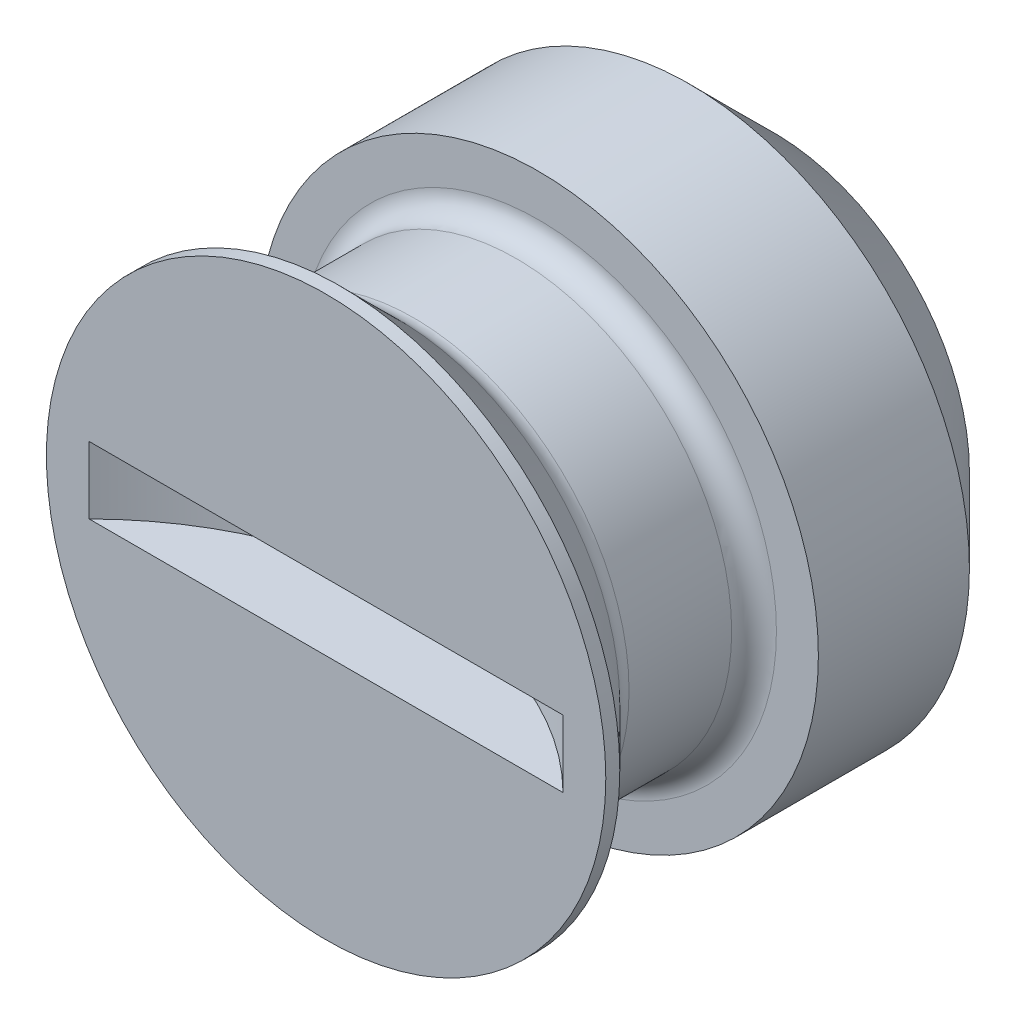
ISO-10303-21;
HEADER;
FILE_DESCRIPTION(('STEP AP214'),'2;1');
FILE_NAME('part.step','',(''),(''),'','','');
FILE_SCHEMA(('AUTOMOTIVE_DESIGN { 1 0 10303 214 1 1 1 1 }'));
ENDSEC;
DATA;
#1=APPLICATION_CONTEXT('core data for automotive mechanical design processes');
#2=APPLICATION_PROTOCOL_DEFINITION('international standard','automotive_design',2000,#1);
#3=PRODUCT_CONTEXT('',#1,'mechanical');
#4=PRODUCT('Part','Part','',(#3));
#5=PRODUCT_RELATED_PRODUCT_CATEGORY('part','',(#4));
#6=PRODUCT_DEFINITION_FORMATION('','',#4);
#7=PRODUCT_DEFINITION_CONTEXT('part definition',#1,'design');
#8=PRODUCT_DEFINITION('design','',#6,#7);
#9=PRODUCT_DEFINITION_SHAPE('','',#8);
#10=(LENGTH_UNIT() NAMED_UNIT(*) SI_UNIT(.MILLI.,.METRE.));
#11=(NAMED_UNIT(*) PLANE_ANGLE_UNIT() SI_UNIT($,.RADIAN.));
#12=(NAMED_UNIT(*) SI_UNIT($,.STERADIAN.) SOLID_ANGLE_UNIT());
#13=UNCERTAINTY_MEASURE_WITH_UNIT(LENGTH_MEASURE(1.E-05),#10,'distance_accuracy_value','');
#14=(GEOMETRIC_REPRESENTATION_CONTEXT(3) GLOBAL_UNCERTAINTY_ASSIGNED_CONTEXT((#13)) GLOBAL_UNIT_ASSIGNED_CONTEXT((#10,
#11,#12)) REPRESENTATION_CONTEXT('',''));
#15=CARTESIAN_POINT('',(0.,0.,0.));
#16=DIRECTION('',(0.,0.,1.));
#17=DIRECTION('',(1.,0.,0.));
#18=AXIS2_PLACEMENT_3D('',#15,#16,#17);
#19=CARTESIAN_POINT('',(0.,5.,0.));
#20=DIRECTION('',(0.,0.,-1.));
#21=DIRECTION('',(-1.,0.,0.));
#22=AXIS2_PLACEMENT_3D('',#19,#20,#21);
#23=PLANE('',#22);
#24=CARTESIAN_POINT('',(0.,0.,0.));
#25=DIRECTION('',(0.,0.,1.));
#26=DIRECTION('',(1.,0.,0.));
#27=AXIS2_PLACEMENT_3D('',#24,#25,#26);
#28=CIRCLE('',#27,5.);
#29=CARTESIAN_POINT('',(5.,0.,0.));
#30=VERTEX_POINT('',#29);
#31=EDGE_CURVE('E76',#30,#30,#28,.T.);
#32=ORIENTED_EDGE('',*,*,#31,.T.);
#33=EDGE_LOOP('',(#32));
#34=FACE_BOUND('',#33,.T.);
#35=DIRECTION('',(1.,0.,0.));
#36=VECTOR('',#35,1.);
#37=CARTESIAN_POINT('',(0.,-0.6,0.));
#38=LINE('',#37,#36);
#39=CARTESIAN_POINT('',(-4.23526858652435,-0.6,0.));
#40=VERTEX_POINT('',#39);
#41=CARTESIAN_POINT('',(4.23526858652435,-0.6,0.));
#42=VERTEX_POINT('',#41);
#43=EDGE_CURVE('E9',#40,#42,#38,.T.);
#44=ORIENTED_EDGE('',*,*,#43,.F.);
#45=DIRECTION('',(0.,1.,0.));
#46=VECTOR('',#45,1.);
#47=CARTESIAN_POINT('',(-4.23526858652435,-0.6,0.));
#48=LINE('',#47,#46);
#49=CARTESIAN_POINT('',(-4.23526858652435,0.6,0.));
#50=VERTEX_POINT('',#49);
#51=EDGE_CURVE('E22',#40,#50,#48,.T.);
#52=ORIENTED_EDGE('',*,*,#51,.T.);
#53=DIRECTION('',(1.,0.,0.));
#54=VECTOR('',#53,1.);
#55=CARTESIAN_POINT('',(0.,0.6,0.));
#56=LINE('',#55,#54);
#57=CARTESIAN_POINT('',(4.23526858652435,0.6,0.));
#58=VERTEX_POINT('',#57);
#59=EDGE_CURVE('E40',#50,#58,#56,.T.);
#60=ORIENTED_EDGE('',*,*,#59,.T.);
#61=DIRECTION('',(0.,1.,0.));
#62=VECTOR('',#61,1.);
#63=CARTESIAN_POINT('',(4.23526858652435,-0.6,0.));
#64=LINE('',#63,#62);
#65=EDGE_CURVE('E44',#58,#42,#64,.F.);
#66=ORIENTED_EDGE('',*,*,#65,.T.);
#67=EDGE_LOOP('',(#44,#52,#60,#66));
#68=FACE_BOUND('',#67,.T.);
#69=ADVANCED_FACE('F14',(#34,#68),#23,.F.);
#70=CARTESIAN_POINT('',(0.,3.49999999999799,-7.99999999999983));
#71=DIRECTION('',(0.,0.,1.));
#72=DIRECTION('',(1.,0.,0.));
#73=AXIS2_PLACEMENT_3D('',#70,#71,#72);
#74=PLANE('',#73);
#75=CARTESIAN_POINT('',(0.,0.,-7.99999999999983));
#76=DIRECTION('',(0.,0.,1.));
#77=DIRECTION('',(1.,0.,0.));
#78=AXIS2_PLACEMENT_3D('',#75,#76,#77);
#79=CIRCLE('',#78,3.49999999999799);
#80=CARTESIAN_POINT('',(3.49999999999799,0.,-7.99999999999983));
#81=VERTEX_POINT('',#80);
#82=EDGE_CURVE('E45',#81,#81,#79,.T.);
#83=ORIENTED_EDGE('',*,*,#82,.F.);
#84=EDGE_LOOP('',(#83));
#85=FACE_BOUND('',#84,.T.);
#86=ADVANCED_FACE('F16',(#85),#74,.F.);
#87=CARTESIAN_POINT('',(0.,0.,-7.99999999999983));
#88=DIRECTION('',(0.,0.,1.));
#89=DIRECTION('',(1.,0.,0.));
#90=AXIS2_PLACEMENT_3D('',#87,#88,#89);
#91=CONICAL_SURFACE('',#90,3.49999999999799,0.785398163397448);
#92=CARTESIAN_POINT('',(0.,0.,-6.49999999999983));
#93=DIRECTION('',(0.,0.,1.));
#94=DIRECTION('',(1.,0.,0.));
#95=AXIS2_PLACEMENT_3D('',#92,#93,#94);
#96=CIRCLE('',#95,4.99999999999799);
#97=CARTESIAN_POINT('',(4.99999999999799,0.,-6.49999999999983));
#98=VERTEX_POINT('',#97);
#99=EDGE_CURVE('E55',#98,#98,#96,.T.);
#100=ORIENTED_EDGE('',*,*,#99,.F.);
#101=EDGE_LOOP('',(#100));
#102=FACE_BOUND('',#101,.T.);
#103=ORIENTED_EDGE('',*,*,#82,.T.);
#104=EDGE_LOOP('',(#103));
#105=FACE_BOUND('',#104,.T.);
#106=ADVANCED_FACE('F99',(#102,#105),#91,.T.);
#107=CARTESIAN_POINT('',(0.,0.,0.));
#108=DIRECTION('',(0.,0.,1.));
#109=DIRECTION('',(1.,0.,0.));
#110=AXIS2_PLACEMENT_3D('',#107,#108,#109);
#111=CYLINDRICAL_SURFACE('',#110,4.99999999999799);
#112=CARTESIAN_POINT('',(0.,0.,-3.80000000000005));
#113=DIRECTION('',(0.,0.,1.));
#114=DIRECTION('',(1.,0.,0.));
#115=AXIS2_PLACEMENT_3D('',#112,#113,#114);
#116=CIRCLE('',#115,4.99999999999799);
#117=CARTESIAN_POINT('',(4.99999999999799,0.,-3.80000000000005));
#118=VERTEX_POINT('',#117);
#119=EDGE_CURVE('E58',#118,#118,#116,.T.);
#120=ORIENTED_EDGE('',*,*,#119,.F.);
#121=EDGE_LOOP('',(#120));
#122=FACE_BOUND('',#121,.T.);
#123=ORIENTED_EDGE('',*,*,#99,.T.);
#124=EDGE_LOOP('',(#123));
#125=FACE_BOUND('',#124,.T.);
#126=ADVANCED_FACE('F124',(#122,#125),#111,.T.);
#127=CARTESIAN_POINT('',(0.,4.99999999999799,-3.80000000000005));
#128=DIRECTION('',(0.,0.,-1.));
#129=DIRECTION('',(-1.,0.,0.));
#130=AXIS2_PLACEMENT_3D('',#127,#128,#129);
#131=PLANE('',#130);
#132=CARTESIAN_POINT('',(0.,0.,-3.80000000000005));
#133=DIRECTION('',(0.,0.,1.));
#134=DIRECTION('',(1.,0.,0.));
#135=AXIS2_PLACEMENT_3D('',#132,#133,#134);
#136=CIRCLE('',#135,4.24999999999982);
#137=CARTESIAN_POINT('',(4.24999999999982,0.,-3.80000000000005));
#138=VERTEX_POINT('',#137);
#139=EDGE_CURVE('E61',#138,#138,#136,.T.);
#140=ORIENTED_EDGE('',*,*,#139,.F.);
#141=EDGE_LOOP('',(#140));
#142=FACE_BOUND('',#141,.T.);
#143=ORIENTED_EDGE('',*,*,#119,.T.);
#144=EDGE_LOOP('',(#143));
#145=FACE_BOUND('',#144,.T.);
#146=ADVANCED_FACE('F120',(#142,#145),#131,.F.);
#147=CARTESIAN_POINT('',(0.,0.,-3.40000000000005));
#148=DIRECTION('',(0.,0.,1.));
#149=DIRECTION('',(1.,0.,0.));
#150=AXIS2_PLACEMENT_3D('',#147,#148,#149);
#151=TOROIDAL_SURFACE('',#150,4.24999999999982,0.4);
#152=CARTESIAN_POINT('',(0.,0.,-3.40000000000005));
#153=DIRECTION('',(0.,0.,1.));
#154=DIRECTION('',(1.,0.,0.));
#155=AXIS2_PLACEMENT_3D('',#152,#153,#154);
#156=CIRCLE('',#155,3.84999999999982);
#157=CARTESIAN_POINT('',(3.84999999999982,0.,-3.40000000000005));
#158=VERTEX_POINT('',#157);
#159=EDGE_CURVE('E64',#158,#158,#156,.T.);
#160=ORIENTED_EDGE('',*,*,#159,.F.);
#161=EDGE_LOOP('',(#160));
#162=FACE_BOUND('',#161,.T.);
#163=ORIENTED_EDGE('',*,*,#139,.T.);
#164=EDGE_LOOP('',(#163));
#165=FACE_BOUND('',#164,.T.);
#166=ADVANCED_FACE('F116',(#162,#165),#151,.F.);
#167=CARTESIAN_POINT('',(0.,0.,0.));
#168=DIRECTION('',(0.,0.,1.));
#169=DIRECTION('',(1.,0.,0.));
#170=AXIS2_PLACEMENT_3D('',#167,#168,#169);
#171=CYLINDRICAL_SURFACE('',#170,3.84999999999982);
#172=CARTESIAN_POINT('',(0.,0.,-1.56568542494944));
#173=DIRECTION('',(0.,0.,1.));
#174=DIRECTION('',(1.,0.,0.));
#175=AXIS2_PLACEMENT_3D('',#172,#173,#174);
#176=CIRCLE('',#175,3.84999999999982);
#177=CARTESIAN_POINT('',(3.84999999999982,0.,-1.56568542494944));
#178=VERTEX_POINT('',#177);
#179=EDGE_CURVE('E67',#178,#178,#176,.T.);
#180=ORIENTED_EDGE('',*,*,#179,.F.);
#181=EDGE_LOOP('',(#180));
#182=FACE_BOUND('',#181,.T.);
#183=ORIENTED_EDGE('',*,*,#159,.T.);
#184=EDGE_LOOP('',(#183));
#185=FACE_BOUND('',#184,.T.);
#186=ADVANCED_FACE('F112',(#182,#185),#171,.T.);
#187=CARTESIAN_POINT('',(0.,0.,-1.56568542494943));
#188=DIRECTION('',(0.,0.,1.));
#189=DIRECTION('',(1.,0.,0.));
#190=AXIS2_PLACEMENT_3D('',#187,#188,#189);
#191=TOROIDAL_SURFACE('',#190,4.24999999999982,0.4);
#192=CARTESIAN_POINT('',(0.,0.,-1.28284271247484));
#193=DIRECTION('',(0.,0.,1.));
#194=DIRECTION('',(1.,0.,0.));
#195=AXIS2_PLACEMENT_3D('',#192,#193,#194);
#196=CIRCLE('',#195,3.96715728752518);
#197=CARTESIAN_POINT('',(3.96715728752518,0.,-1.28284271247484));
#198=VERTEX_POINT('',#197);
#199=EDGE_CURVE('E70',#198,#198,#196,.T.);
#200=ORIENTED_EDGE('',*,*,#199,.F.);
#201=EDGE_LOOP('',(#200));
#202=FACE_BOUND('',#201,.T.);
#203=ORIENTED_EDGE('',*,*,#179,.T.);
#204=EDGE_LOOP('',(#203));
#205=FACE_BOUND('',#204,.T.);
#206=ADVANCED_FACE('F108',(#202,#205),#191,.F.);
#207=CARTESIAN_POINT('',(0.,0.,-1.28284271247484));
#208=DIRECTION('',(0.,0.,1.));
#209=DIRECTION('',(1.,0.,0.));
#210=AXIS2_PLACEMENT_3D('',#207,#208,#209);
#211=CONICAL_SURFACE('',#210,3.96715728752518,0.785398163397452);
#212=CARTESIAN_POINT('',(0.,0.,-0.250000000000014));
#213=DIRECTION('',(0.,0.,1.));
#214=DIRECTION('',(1.,0.,0.));
#215=AXIS2_PLACEMENT_3D('',#212,#213,#214);
#216=CIRCLE('',#215,5.);
#217=CARTESIAN_POINT('',(5.,0.,-0.250000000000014));
#218=VERTEX_POINT('',#217);
#219=EDGE_CURVE('E73',#218,#218,#216,.T.);
#220=ORIENTED_EDGE('',*,*,#219,.F.);
#221=EDGE_LOOP('',(#220));
#222=FACE_BOUND('',#221,.T.);
#223=ORIENTED_EDGE('',*,*,#199,.T.);
#224=EDGE_LOOP('',(#223));
#225=FACE_BOUND('',#224,.T.);
#226=ADVANCED_FACE('F104',(#222,#225),#211,.T.);
#227=CARTESIAN_POINT('',(0.,0.,0.));
#228=DIRECTION('',(0.,0.,1.));
#229=DIRECTION('',(1.,0.,0.));
#230=AXIS2_PLACEMENT_3D('',#227,#228,#229);
#231=CYLINDRICAL_SURFACE('',#230,5.);
#232=ORIENTED_EDGE('',*,*,#31,.F.);
#233=EDGE_LOOP('',(#232));
#234=FACE_BOUND('',#233,.T.);
#235=ORIENTED_EDGE('',*,*,#219,.T.);
#236=EDGE_LOOP('',(#235));
#237=FACE_BOUND('',#236,.T.);
#238=ADVANCED_FACE('F90',(#234,#237),#231,.T.);
#239=CARTESIAN_POINT('',(0.,-0.6,4.25));
#240=DIRECTION('',(0.,1.,0.));
#241=DIRECTION('',(1.,0.,0.));
#242=AXIS2_PLACEMENT_3D('',#239,#240,#241);
#243=CYLINDRICAL_SURFACE('',#242,6.);
#244=CARTESIAN_POINT('',(0.,-0.6,4.25));
#245=DIRECTION('',(0.,1.,0.));
#246=DIRECTION('',(1.,0.,0.));
#247=AXIS2_PLACEMENT_3D('',#244,#245,#246);
#248=CIRCLE('',#247,6.);
#249=EDGE_CURVE('E48',#42,#40,#248,.T.);
#250=ORIENTED_EDGE('',*,*,#249,.F.);
#251=ORIENTED_EDGE('',*,*,#65,.F.);
#252=CARTESIAN_POINT('',(0.,0.6,4.25));
#253=DIRECTION('',(0.,1.,0.));
#254=DIRECTION('',(1.,0.,0.));
#255=AXIS2_PLACEMENT_3D('',#252,#253,#254);
#256=CIRCLE('',#255,6.);
#257=EDGE_CURVE('E28',#58,#50,#256,.T.);
#258=ORIENTED_EDGE('',*,*,#257,.T.);
#259=ORIENTED_EDGE('',*,*,#51,.F.);
#260=EDGE_LOOP('',(#250,#251,#258,#259));
#261=FACE_BOUND('',#260,.T.);
#262=ADVANCED_FACE('F47',(#261),#243,.F.);
#263=CARTESIAN_POINT('',(0.,-0.6,4.25));
#264=DIRECTION('',(0.,1.,0.));
#265=DIRECTION('',(1.,0.,0.));
#266=AXIS2_PLACEMENT_3D('',#263,#264,#265);
#267=PLANE('',#266);
#268=ORIENTED_EDGE('',*,*,#43,.T.);
#269=ORIENTED_EDGE('',*,*,#249,.T.);
#270=EDGE_LOOP('',(#268,#269));
#271=FACE_BOUND('',#270,.T.);
#272=ADVANCED_FACE('F80',(#271),#267,.T.);
#273=CARTESIAN_POINT('',(0.,0.6,4.25));
#274=DIRECTION('',(0.,1.,0.));
#275=DIRECTION('',(1.,0.,0.));
#276=AXIS2_PLACEMENT_3D('',#273,#274,#275);
#277=PLANE('',#276);
#278=ORIENTED_EDGE('',*,*,#257,.F.);
#279=ORIENTED_EDGE('',*,*,#59,.F.);
#280=EDGE_LOOP('',(#278,#279));
#281=FACE_BOUND('',#280,.T.);
#282=ADVANCED_FACE('F41',(#281),#277,.F.);
#283=CLOSED_SHELL('',(#69,#86,#106,#126,#146,#166,#186,#206,#226,#238,#262,#272,#282));
#284=MANIFOLD_SOLID_BREP('B1',#283);
#285=ADVANCED_BREP_SHAPE_REPRESENTATION('',(#18,#284),#14);
#286=SHAPE_DEFINITION_REPRESENTATION(#9,#285);
ENDSEC;
END-ISO-10303-21;
